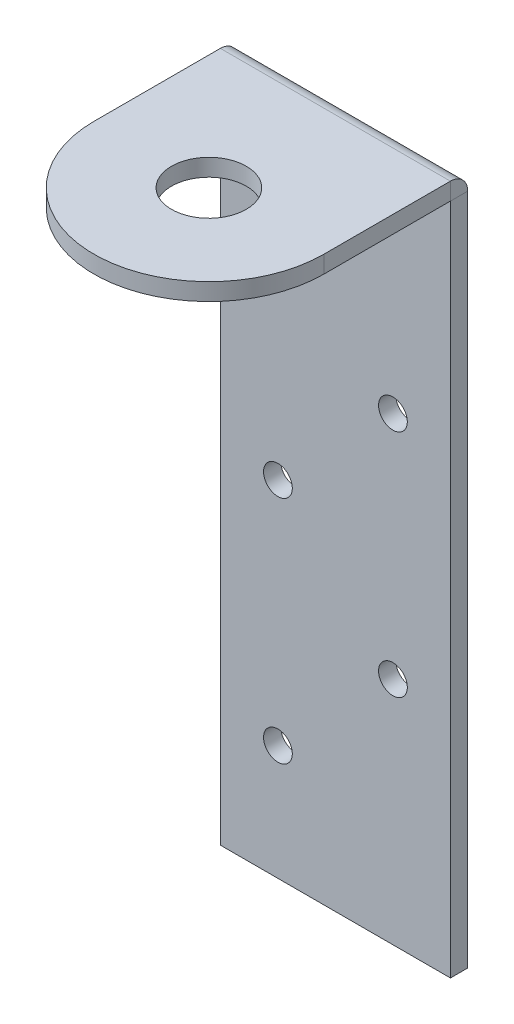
ISO-10303-21;
HEADER;
FILE_DESCRIPTION(('STEP AP214'),'2;1');
FILE_NAME('part.step','',(''),(''),'','','');
FILE_SCHEMA(('AUTOMOTIVE_DESIGN { 1 0 10303 214 1 1 1 1 }'));
ENDSEC;
DATA;
#1=APPLICATION_CONTEXT('core data for automotive mechanical design processes');
#2=APPLICATION_PROTOCOL_DEFINITION('international standard','automotive_design',2000,#1);
#3=PRODUCT_CONTEXT('',#1,'mechanical');
#4=PRODUCT('Part','Part','',(#3));
#5=PRODUCT_RELATED_PRODUCT_CATEGORY('part','',(#4));
#6=PRODUCT_DEFINITION_FORMATION('','',#4);
#7=PRODUCT_DEFINITION_CONTEXT('part definition',#1,'design');
#8=PRODUCT_DEFINITION('design','',#6,#7);
#9=PRODUCT_DEFINITION_SHAPE('','',#8);
#10=(LENGTH_UNIT() NAMED_UNIT(*) SI_UNIT(.MILLI.,.METRE.));
#11=(NAMED_UNIT(*) PLANE_ANGLE_UNIT() SI_UNIT($,.RADIAN.));
#12=(NAMED_UNIT(*) SI_UNIT($,.STERADIAN.) SOLID_ANGLE_UNIT());
#13=UNCERTAINTY_MEASURE_WITH_UNIT(LENGTH_MEASURE(1.E-05),#10,'distance_accuracy_value','');
#14=(GEOMETRIC_REPRESENTATION_CONTEXT(3) GLOBAL_UNCERTAINTY_ASSIGNED_CONTEXT((#13)) GLOBAL_UNIT_ASSIGNED_CONTEXT((#10,
#11,#12)) REPRESENTATION_CONTEXT('',''));
#15=CARTESIAN_POINT('',(0.,0.,0.));
#16=DIRECTION('',(0.,0.,1.));
#17=DIRECTION('',(1.,0.,0.));
#18=AXIS2_PLACEMENT_3D('',#15,#16,#17);
#19=CARTESIAN_POINT('',(40.,117.005,-119.995));
#20=DIRECTION('',(-1.,0.,0.));
#21=DIRECTION('',(0.,-1.,0.));
#22=AXIS2_PLACEMENT_3D('',#19,#20,#21);
#23=PLANE('',#22);
#24=DIRECTION('',(0.,0.,1.));
#25=VECTOR('',#24,1.);
#26=CARTESIAN_POINT('',(40.,117.005,-119.995));
#27=LINE('',#26,#25);
#28=CARTESIAN_POINT('',(40.,117.005,3.01));
#29=VERTEX_POINT('',#28);
#30=CARTESIAN_POINT('',(40.,117.005,25.005));
#31=VERTEX_POINT('',#30);
#32=EDGE_CURVE('E39',#29,#31,#27,.T.);
#33=ORIENTED_EDGE('',*,*,#32,.F.);
#34=DIRECTION('',(0.,1.,0.));
#35=VECTOR('',#34,1.);
#36=CARTESIAN_POINT('',(40.,117.004999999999,3.00999999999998));
#37=LINE('',#36,#35);
#38=CARTESIAN_POINT('',(40.,120.005,3.01000000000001));
#39=VERTEX_POINT('',#38);
#40=EDGE_CURVE('E12',#29,#39,#37,.T.);
#41=ORIENTED_EDGE('',*,*,#40,.T.);
#42=DIRECTION('',(0.,0.,1.));
#43=VECTOR('',#42,1.);
#44=CARTESIAN_POINT('',(40.,120.005,-119.995));
#45=LINE('',#44,#43);
#46=CARTESIAN_POINT('',(40.,120.005,25.005));
#47=VERTEX_POINT('',#46);
#48=EDGE_CURVE('E52',#39,#47,#45,.T.);
#49=ORIENTED_EDGE('',*,*,#48,.T.);
#50=DIRECTION('',(0.,1.,0.));
#51=VECTOR('',#50,1.);
#52=CARTESIAN_POINT('',(40.,117.005,25.005));
#53=LINE('',#52,#51);
#54=EDGE_CURVE('E196',#31,#47,#53,.T.);
#55=ORIENTED_EDGE('',*,*,#54,.F.);
#56=EDGE_LOOP('',(#33,#41,#49,#55));
#57=FACE_BOUND('',#56,.T.);
#58=ADVANCED_FACE('F36',(#57),#23,.F.);
#59=CARTESIAN_POINT('',(0.,117.005,-119.995));
#60=DIRECTION('',(1.,0.,0.));
#61=DIRECTION('',(0.,1.,0.));
#62=AXIS2_PLACEMENT_3D('',#59,#60,#61);
#63=PLANE('',#62);
#64=DIRECTION('',(0.,0.,-1.));
#65=VECTOR('',#64,1.);
#66=CARTESIAN_POINT('',(0.,120.005,-119.995));
#67=LINE('',#66,#65);
#68=CARTESIAN_POINT('',(0.,120.005,25.005));
#69=VERTEX_POINT('',#68);
#70=CARTESIAN_POINT('',(0.,120.005,3.01000000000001));
#71=VERTEX_POINT('',#70);
#72=EDGE_CURVE('E59',#69,#71,#67,.T.);
#73=ORIENTED_EDGE('',*,*,#72,.T.);
#74=DIRECTION('',(0.,-1.,0.));
#75=VECTOR('',#74,1.);
#76=CARTESIAN_POINT('',(0.,117.004999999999,3.00999999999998));
#77=LINE('',#76,#75);
#78=CARTESIAN_POINT('',(0.,117.005000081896,3.01));
#79=VERTEX_POINT('',#78);
#80=EDGE_CURVE('E200',#71,#79,#77,.T.);
#81=ORIENTED_EDGE('',*,*,#80,.T.);
#82=DIRECTION('',(0.,0.,-1.));
#83=VECTOR('',#82,1.);
#84=CARTESIAN_POINT('',(0.,117.005,-119.995));
#85=LINE('',#84,#83);
#86=CARTESIAN_POINT('',(0.,117.005,25.005));
#87=VERTEX_POINT('',#86);
#88=EDGE_CURVE('E191',#87,#79,#85,.T.);
#89=ORIENTED_EDGE('',*,*,#88,.F.);
#90=DIRECTION('',(0.,1.,0.));
#91=VECTOR('',#90,1.);
#92=CARTESIAN_POINT('',(0.,117.005,25.005));
#93=LINE('',#92,#91);
#94=EDGE_CURVE('E194',#87,#69,#93,.T.);
#95=ORIENTED_EDGE('',*,*,#94,.T.);
#96=EDGE_LOOP('',(#73,#81,#89,#95));
#97=FACE_BOUND('',#96,.T.);
#98=ADVANCED_FACE('F217',(#97),#63,.F.);
#99=CARTESIAN_POINT('',(20.,120.005,25.005));
#100=DIRECTION('',(0.,-1.,0.));
#101=DIRECTION('',(1.,0.,0.));
#102=AXIS2_PLACEMENT_3D('',#99,#100,#101);
#103=PLANE('',#102);
#104=CARTESIAN_POINT('',(20.,120.005,25.005));
#105=DIRECTION('',(0.,-1.,0.));
#106=DIRECTION('',(1.,0.,0.));
#107=AXIS2_PLACEMENT_3D('',#104,#105,#106);
#108=CIRCLE('',#107,6.5);
#109=CARTESIAN_POINT('',(26.5,120.005,25.005));
#110=VERTEX_POINT('',#109);
#111=EDGE_CURVE('E149',#110,#110,#108,.T.);
#112=ORIENTED_EDGE('',*,*,#111,.T.);
#113=EDGE_LOOP('',(#112));
#114=FACE_BOUND('',#113,.T.);
#115=ORIENTED_EDGE('',*,*,#48,.F.);
#116=DIRECTION('',(-1.,0.,0.));
#117=VECTOR('',#116,1.);
#118=CARTESIAN_POINT('',(20.,120.005,3.01000000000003));
#119=LINE('',#118,#117);
#120=EDGE_CURVE('E44',#39,#71,#119,.T.);
#121=ORIENTED_EDGE('',*,*,#120,.T.);
#122=ORIENTED_EDGE('',*,*,#72,.F.);
#123=CARTESIAN_POINT('',(20.,120.005,25.005));
#124=DIRECTION('',(0.,-1.,0.));
#125=DIRECTION('',(1.,0.,0.));
#126=AXIS2_PLACEMENT_3D('',#123,#124,#125);
#127=CIRCLE('',#126,20.);
#128=EDGE_CURVE('E189',#47,#69,#127,.T.);
#129=ORIENTED_EDGE('',*,*,#128,.F.);
#130=EDGE_LOOP('',(#115,#121,#122,#129));
#131=FACE_BOUND('',#130,.T.);
#132=ADVANCED_FACE('F256',(#114,#131),#103,.F.);
#133=CARTESIAN_POINT('',(20.,117.005,25.005));
#134=DIRECTION('',(0.,-1.,0.));
#135=DIRECTION('',(1.,0.,0.));
#136=AXIS2_PLACEMENT_3D('',#133,#134,#135);
#137=PLANE('',#136);
#138=DIRECTION('',(-1.,0.,0.));
#139=VECTOR('',#138,1.);
#140=CARTESIAN_POINT('',(20.,117.005,3.00999999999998));
#141=LINE('',#140,#139);
#142=EDGE_CURVE('E138',#29,#79,#141,.T.);
#143=ORIENTED_EDGE('',*,*,#142,.F.);
#144=ORIENTED_EDGE('',*,*,#32,.T.);
#145=CARTESIAN_POINT('',(20.,117.005,25.005));
#146=DIRECTION('',(0.,-1.,0.));
#147=DIRECTION('',(1.,0.,0.));
#148=AXIS2_PLACEMENT_3D('',#145,#146,#147);
#149=CIRCLE('',#148,20.);
#150=EDGE_CURVE('E192',#31,#87,#149,.T.);
#151=ORIENTED_EDGE('',*,*,#150,.T.);
#152=ORIENTED_EDGE('',*,*,#88,.T.);
#153=EDGE_LOOP('',(#143,#144,#151,#152));
#154=FACE_BOUND('',#153,.T.);
#155=CARTESIAN_POINT('',(20.,117.005,25.005));
#156=DIRECTION('',(0.,-1.,0.));
#157=DIRECTION('',(1.,0.,0.));
#158=AXIS2_PLACEMENT_3D('',#155,#156,#157);
#159=CIRCLE('',#158,6.5);
#160=CARTESIAN_POINT('',(26.5,117.005,25.005));
#161=VERTEX_POINT('',#160);
#162=EDGE_CURVE('E186',#161,#161,#159,.T.);
#163=ORIENTED_EDGE('',*,*,#162,.F.);
#164=EDGE_LOOP('',(#163));
#165=FACE_BOUND('',#164,.T.);
#166=ADVANCED_FACE('F209',(#154,#165),#137,.T.);
#167=CARTESIAN_POINT('',(20.,117.005,25.005));
#168=DIRECTION('',(0.,1.,0.));
#169=DIRECTION('',(-1.,0.,0.));
#170=AXIS2_PLACEMENT_3D('',#167,#168,#169);
#171=CYLINDRICAL_SURFACE('',#170,20.);
#172=ORIENTED_EDGE('',*,*,#128,.T.);
#173=ORIENTED_EDGE('',*,*,#94,.F.);
#174=ORIENTED_EDGE('',*,*,#150,.F.);
#175=ORIENTED_EDGE('',*,*,#54,.T.);
#176=EDGE_LOOP('',(#172,#173,#174,#175));
#177=FACE_BOUND('',#176,.T.);
#178=ADVANCED_FACE('F216',(#177),#171,.T.);
#179=CARTESIAN_POINT('',(20.,117.005,25.005));
#180=DIRECTION('',(0.,1.,0.));
#181=DIRECTION('',(-1.,0.,0.));
#182=AXIS2_PLACEMENT_3D('',#179,#180,#181);
#183=CYLINDRICAL_SURFACE('',#182,6.5);
#184=ORIENTED_EDGE('',*,*,#162,.T.);
#185=EDGE_LOOP('',(#184));
#186=FACE_BOUND('',#185,.T.);
#187=ORIENTED_EDGE('',*,*,#111,.F.);
#188=EDGE_LOOP('',(#187));
#189=FACE_BOUND('',#188,.T.);
#190=ADVANCED_FACE('F240',(#186,#189),#183,.F.);
#191=CARTESIAN_POINT('',(0.,0.,3.));
#192=DIRECTION('',(0.,1.,0.));
#193=DIRECTION('',(0.,0.,1.));
#194=AXIS2_PLACEMENT_3D('',#191,#192,#193);
#195=PLANE('',#194);
#196=DIRECTION('',(1.,0.,0.));
#197=VECTOR('',#196,1.);
#198=CARTESIAN_POINT('',(0.,0.,0.));
#199=LINE('',#198,#197);
#200=CARTESIAN_POINT('',(0.,0.,0.));
#201=VERTEX_POINT('',#200);
#202=CARTESIAN_POINT('',(40.,0.,0.));
#203=VERTEX_POINT('',#202);
#204=EDGE_CURVE('E133',#201,#203,#199,.T.);
#205=ORIENTED_EDGE('',*,*,#204,.T.);
#206=DIRECTION('',(0.,0.,-1.));
#207=VECTOR('',#206,1.);
#208=CARTESIAN_POINT('',(40.,0.,3.));
#209=LINE('',#208,#207);
#210=CARTESIAN_POINT('',(40.,0.,3.));
#211=VERTEX_POINT('',#210);
#212=EDGE_CURVE('E150',#211,#203,#209,.T.);
#213=ORIENTED_EDGE('',*,*,#212,.F.);
#214=DIRECTION('',(1.,0.,0.));
#215=VECTOR('',#214,1.);
#216=CARTESIAN_POINT('',(0.,0.,3.));
#217=LINE('',#216,#215);
#218=CARTESIAN_POINT('',(0.,0.,3.));
#219=VERTEX_POINT('',#218);
#220=EDGE_CURVE('E112',#219,#211,#217,.T.);
#221=ORIENTED_EDGE('',*,*,#220,.F.);
#222=DIRECTION('',(0.,0.,-1.));
#223=VECTOR('',#222,1.);
#224=CARTESIAN_POINT('',(0.,0.,3.));
#225=LINE('',#224,#223);
#226=EDGE_CURVE('E109',#219,#201,#225,.T.);
#227=ORIENTED_EDGE('',*,*,#226,.T.);
#228=EDGE_LOOP('',(#205,#213,#221,#227));
#229=FACE_BOUND('',#228,.T.);
#230=ADVANCED_FACE('F237',(#229),#195,.F.);
#231=CARTESIAN_POINT('',(30.,80.,3.));
#232=DIRECTION('',(0.,0.,-1.));
#233=DIRECTION('',(-1.,0.,0.));
#234=AXIS2_PLACEMENT_3D('',#231,#232,#233);
#235=CYLINDRICAL_SURFACE('',#234,2.5);
#236=CARTESIAN_POINT('',(30.,80.,3.));
#237=DIRECTION('',(0.,0.,1.));
#238=DIRECTION('',(1.,0.,0.));
#239=AXIS2_PLACEMENT_3D('',#236,#237,#238);
#240=CIRCLE('',#239,2.5);
#241=CARTESIAN_POINT('',(32.5,80.,3.));
#242=VERTEX_POINT('',#241);
#243=EDGE_CURVE('E178',#242,#242,#240,.T.);
#244=ORIENTED_EDGE('',*,*,#243,.T.);
#245=EDGE_LOOP('',(#244));
#246=FACE_BOUND('',#245,.T.);
#247=CARTESIAN_POINT('',(30.,80.,0.));
#248=DIRECTION('',(0.,0.,1.));
#249=DIRECTION('',(1.,0.,0.));
#250=AXIS2_PLACEMENT_3D('',#247,#248,#249);
#251=CIRCLE('',#250,2.5);
#252=CARTESIAN_POINT('',(32.5,80.,0.));
#253=VERTEX_POINT('',#252);
#254=EDGE_CURVE('E153',#253,#253,#251,.T.);
#255=ORIENTED_EDGE('',*,*,#254,.F.);
#256=EDGE_LOOP('',(#255));
#257=FACE_BOUND('',#256,.T.);
#258=ADVANCED_FACE('F239',(#246,#257),#235,.F.);
#259=CARTESIAN_POINT('',(30.,40.,3.));
#260=DIRECTION('',(0.,0.,-1.));
#261=DIRECTION('',(-1.,0.,0.));
#262=AXIS2_PLACEMENT_3D('',#259,#260,#261);
#263=CYLINDRICAL_SURFACE('',#262,2.5);
#264=CARTESIAN_POINT('',(30.,40.,3.));
#265=DIRECTION('',(0.,0.,1.));
#266=DIRECTION('',(1.,0.,0.));
#267=AXIS2_PLACEMENT_3D('',#264,#265,#266);
#268=CIRCLE('',#267,2.5);
#269=CARTESIAN_POINT('',(32.5,40.,3.));
#270=VERTEX_POINT('',#269);
#271=EDGE_CURVE('E175',#270,#270,#268,.T.);
#272=ORIENTED_EDGE('',*,*,#271,.T.);
#273=EDGE_LOOP('',(#272));
#274=FACE_BOUND('',#273,.T.);
#275=CARTESIAN_POINT('',(30.,40.,0.));
#276=DIRECTION('',(0.,0.,1.));
#277=DIRECTION('',(1.,0.,0.));
#278=AXIS2_PLACEMENT_3D('',#275,#276,#277);
#279=CIRCLE('',#278,2.5);
#280=CARTESIAN_POINT('',(32.5,40.,0.));
#281=VERTEX_POINT('',#280);
#282=EDGE_CURVE('E156',#281,#281,#279,.T.);
#283=ORIENTED_EDGE('',*,*,#282,.F.);
#284=EDGE_LOOP('',(#283));
#285=FACE_BOUND('',#284,.T.);
#286=ADVANCED_FACE('F246',(#274,#285),#263,.F.);
#287=CARTESIAN_POINT('',(10.,20.,3.));
#288=DIRECTION('',(0.,0.,-1.));
#289=DIRECTION('',(-1.,0.,0.));
#290=AXIS2_PLACEMENT_3D('',#287,#288,#289);
#291=CYLINDRICAL_SURFACE('',#290,2.5);
#292=CARTESIAN_POINT('',(10.,20.,3.));
#293=DIRECTION('',(0.,0.,1.));
#294=DIRECTION('',(1.,0.,0.));
#295=AXIS2_PLACEMENT_3D('',#292,#293,#294);
#296=CIRCLE('',#295,2.5);
#297=CARTESIAN_POINT('',(12.5,20.,3.));
#298=VERTEX_POINT('',#297);
#299=EDGE_CURVE('E172',#298,#298,#296,.T.);
#300=ORIENTED_EDGE('',*,*,#299,.T.);
#301=EDGE_LOOP('',(#300));
#302=FACE_BOUND('',#301,.T.);
#303=CARTESIAN_POINT('',(10.,20.,0.));
#304=DIRECTION('',(0.,0.,1.));
#305=DIRECTION('',(1.,0.,0.));
#306=AXIS2_PLACEMENT_3D('',#303,#304,#305);
#307=CIRCLE('',#306,2.5);
#308=CARTESIAN_POINT('',(12.5,20.,0.));
#309=VERTEX_POINT('',#308);
#310=EDGE_CURVE('E159',#309,#309,#307,.T.);
#311=ORIENTED_EDGE('',*,*,#310,.F.);
#312=EDGE_LOOP('',(#311));
#313=FACE_BOUND('',#312,.T.);
#314=ADVANCED_FACE('F279',(#302,#313),#291,.F.);
#315=CARTESIAN_POINT('',(10.,60.,3.));
#316=DIRECTION('',(0.,0.,-1.));
#317=DIRECTION('',(-1.,0.,0.));
#318=AXIS2_PLACEMENT_3D('',#315,#316,#317);
#319=CYLINDRICAL_SURFACE('',#318,2.5);
#320=CARTESIAN_POINT('',(10.,60.,3.));
#321=DIRECTION('',(0.,0.,1.));
#322=DIRECTION('',(1.,0.,0.));
#323=AXIS2_PLACEMENT_3D('',#320,#321,#322);
#324=CIRCLE('',#323,2.5);
#325=CARTESIAN_POINT('',(12.5,60.,3.));
#326=VERTEX_POINT('',#325);
#327=EDGE_CURVE('E169',#326,#326,#324,.T.);
#328=ORIENTED_EDGE('',*,*,#327,.T.);
#329=EDGE_LOOP('',(#328));
#330=FACE_BOUND('',#329,.T.);
#331=CARTESIAN_POINT('',(10.,60.,0.));
#332=DIRECTION('',(0.,0.,1.));
#333=DIRECTION('',(1.,0.,0.));
#334=AXIS2_PLACEMENT_3D('',#331,#332,#333);
#335=CIRCLE('',#334,2.5);
#336=CARTESIAN_POINT('',(12.5,60.,0.));
#337=VERTEX_POINT('',#336);
#338=EDGE_CURVE('E162',#337,#337,#335,.T.);
#339=ORIENTED_EDGE('',*,*,#338,.F.);
#340=EDGE_LOOP('',(#339));
#341=FACE_BOUND('',#340,.T.);
#342=ADVANCED_FACE('F275',(#330,#341),#319,.F.);
#343=CARTESIAN_POINT('',(20.,145.,3.));
#344=DIRECTION('',(0.,0.,1.));
#345=DIRECTION('',(1.,0.,0.));
#346=AXIS2_PLACEMENT_3D('',#343,#344,#345);
#347=PLANE('',#346);
#348=ORIENTED_EDGE('',*,*,#327,.F.);
#349=EDGE_LOOP('',(#348));
#350=FACE_BOUND('',#349,.T.);
#351=ORIENTED_EDGE('',*,*,#299,.F.);
#352=EDGE_LOOP('',(#351));
#353=FACE_BOUND('',#352,.T.);
#354=ORIENTED_EDGE('',*,*,#271,.F.);
#355=EDGE_LOOP('',(#354));
#356=FACE_BOUND('',#355,.T.);
#357=ORIENTED_EDGE('',*,*,#243,.F.);
#358=EDGE_LOOP('',(#357));
#359=FACE_BOUND('',#358,.T.);
#360=DIRECTION('',(0.,1.,0.));
#361=VECTOR('',#360,1.);
#362=CARTESIAN_POINT('',(40.,0.,3.));
#363=LINE('',#362,#361);
#364=CARTESIAN_POINT('',(40.,116.995,3.));
#365=VERTEX_POINT('',#364);
#366=EDGE_CURVE('E118',#211,#365,#363,.T.);
#367=ORIENTED_EDGE('',*,*,#366,.T.);
#368=DIRECTION('',(-1.,0.,0.));
#369=VECTOR('',#368,1.);
#370=CARTESIAN_POINT('',(20.,116.995,3.));
#371=LINE('',#370,#369);
#372=CARTESIAN_POINT('',(0.,116.995,2.99999991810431));
#373=VERTEX_POINT('',#372);
#374=EDGE_CURVE('E113',#365,#373,#371,.T.);
#375=ORIENTED_EDGE('',*,*,#374,.T.);
#376=DIRECTION('',(0.,-1.,0.));
#377=VECTOR('',#376,1.);
#378=CARTESIAN_POINT('',(0.,0.,3.));
#379=LINE('',#378,#377);
#380=EDGE_CURVE('E102',#373,#219,#379,.T.);
#381=ORIENTED_EDGE('',*,*,#380,.T.);
#382=ORIENTED_EDGE('',*,*,#220,.T.);
#383=EDGE_LOOP('',(#367,#375,#381,#382));
#384=FACE_BOUND('',#383,.T.);
#385=ADVANCED_FACE('F116',(#350,#353,#356,#359,#384),#347,.T.);
#386=CARTESIAN_POINT('',(0.,0.,3.));
#387=DIRECTION('',(1.,0.,0.));
#388=DIRECTION('',(0.,0.,-1.));
#389=AXIS2_PLACEMENT_3D('',#386,#387,#388);
#390=PLANE('',#389);
#391=DIRECTION('',(0.,0.,1.));
#392=VECTOR('',#391,1.);
#393=CARTESIAN_POINT('',(0.,116.995,3.00000000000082));
#394=LINE('',#393,#392);
#395=CARTESIAN_POINT('',(0.,116.995,0.));
#396=VERTEX_POINT('',#395);
#397=EDGE_CURVE('E106',#396,#373,#394,.T.);
#398=ORIENTED_EDGE('',*,*,#397,.F.);
#399=DIRECTION('',(0.,-1.,0.));
#400=VECTOR('',#399,1.);
#401=CARTESIAN_POINT('',(0.,0.,0.));
#402=LINE('',#401,#400);
#403=EDGE_CURVE('E165',#396,#201,#402,.T.);
#404=ORIENTED_EDGE('',*,*,#403,.T.);
#405=ORIENTED_EDGE('',*,*,#226,.F.);
#406=ORIENTED_EDGE('',*,*,#380,.F.);
#407=EDGE_LOOP('',(#398,#404,#405,#406));
#408=FACE_BOUND('',#407,.T.);
#409=ADVANCED_FACE('F104',(#408),#390,.F.);
#410=CARTESIAN_POINT('',(20.,145.,0.));
#411=DIRECTION('',(0.,0.,1.));
#412=DIRECTION('',(1.,0.,0.));
#413=AXIS2_PLACEMENT_3D('',#410,#411,#412);
#414=PLANE('',#413);
#415=DIRECTION('',(-1.,0.,0.));
#416=VECTOR('',#415,1.);
#417=CARTESIAN_POINT('',(20.,116.995,0.));
#418=LINE('',#417,#416);
#419=CARTESIAN_POINT('',(40.,116.995,0.));
#420=VERTEX_POINT('',#419);
#421=EDGE_CURVE('E134',#420,#396,#418,.T.);
#422=ORIENTED_EDGE('',*,*,#421,.F.);
#423=DIRECTION('',(0.,1.,0.));
#424=VECTOR('',#423,1.);
#425=CARTESIAN_POINT('',(40.,0.,0.));
#426=LINE('',#425,#424);
#427=EDGE_CURVE('E147',#203,#420,#426,.T.);
#428=ORIENTED_EDGE('',*,*,#427,.F.);
#429=ORIENTED_EDGE('',*,*,#204,.F.);
#430=ORIENTED_EDGE('',*,*,#403,.F.);
#431=EDGE_LOOP('',(#422,#428,#429,#430));
#432=FACE_BOUND('',#431,.T.);
#433=ORIENTED_EDGE('',*,*,#338,.T.);
#434=EDGE_LOOP('',(#433));
#435=FACE_BOUND('',#434,.T.);
#436=ORIENTED_EDGE('',*,*,#310,.T.);
#437=EDGE_LOOP('',(#436));
#438=FACE_BOUND('',#437,.T.);
#439=ORIENTED_EDGE('',*,*,#282,.T.);
#440=EDGE_LOOP('',(#439));
#441=FACE_BOUND('',#440,.T.);
#442=ORIENTED_EDGE('',*,*,#254,.T.);
#443=EDGE_LOOP('',(#442));
#444=FACE_BOUND('',#443,.T.);
#445=ADVANCED_FACE('F234',(#432,#435,#438,#441,#444),#414,.F.);
#446=CARTESIAN_POINT('',(40.,0.,3.));
#447=DIRECTION('',(-1.,0.,0.));
#448=DIRECTION('',(0.,0.,1.));
#449=AXIS2_PLACEMENT_3D('',#446,#447,#448);
#450=PLANE('',#449);
#451=DIRECTION('',(0.,0.,-1.));
#452=VECTOR('',#451,1.);
#453=CARTESIAN_POINT('',(40.,116.995,3.00000000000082));
#454=LINE('',#453,#452);
#455=EDGE_CURVE('E139',#365,#420,#454,.T.);
#456=ORIENTED_EDGE('',*,*,#455,.F.);
#457=ORIENTED_EDGE('',*,*,#366,.F.);
#458=ORIENTED_EDGE('',*,*,#212,.T.);
#459=ORIENTED_EDGE('',*,*,#427,.T.);
#460=EDGE_LOOP('',(#456,#457,#458,#459));
#461=FACE_BOUND('',#460,.T.);
#462=ADVANCED_FACE('F229',(#461),#450,.F.);
#463=CARTESIAN_POINT('',(40.,116.995,3.01000008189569));
#464=DIRECTION('',(-1.,0.,0.));
#465=DIRECTION('',(0.,0.,1.));
#466=AXIS2_PLACEMENT_3D('',#463,#464,#465);
#467=PLANE('',#466);
#468=ORIENTED_EDGE('',*,*,#455,.T.);
#469=CARTESIAN_POINT('',(40.,116.995,3.01));
#470=DIRECTION('',(-1.,0.,0.));
#471=DIRECTION('',(0.,0.,1.));
#472=AXIS2_PLACEMENT_3D('',#469,#470,#471);
#473=CIRCLE('',#472,3.01000008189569);
#474=EDGE_CURVE('E224',#420,#39,#473,.F.);
#475=ORIENTED_EDGE('',*,*,#474,.T.);
#476=ORIENTED_EDGE('',*,*,#40,.F.);
#477=CARTESIAN_POINT('',(40.,116.995,3.01000008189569));
#478=DIRECTION('',(1.,0.,0.));
#479=DIRECTION('',(0.,0.,-1.));
#480=AXIS2_PLACEMENT_3D('',#477,#478,#479);
#481=CIRCLE('',#480,0.0100001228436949);
#482=EDGE_CURVE('E140',#365,#29,#481,.T.);
#483=ORIENTED_EDGE('',*,*,#482,.F.);
#484=EDGE_LOOP('',(#468,#475,#476,#483));
#485=FACE_BOUND('',#484,.T.);
#486=ADVANCED_FACE('F227',(#485),#467,.F.);
#487=CARTESIAN_POINT('',(0.,116.995,3.01000008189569));
#488=DIRECTION('',(1.,0.,0.));
#489=DIRECTION('',(0.,0.,-1.));
#490=AXIS2_PLACEMENT_3D('',#487,#488,#489);
#491=PLANE('',#490);
#492=CARTESIAN_POINT('',(0.,116.995,3.01));
#493=DIRECTION('',(-1.,0.,0.));
#494=DIRECTION('',(0.,0.,1.));
#495=AXIS2_PLACEMENT_3D('',#492,#493,#494);
#496=CIRCLE('',#495,3.01000008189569);
#497=EDGE_CURVE('E132',#71,#396,#496,.T.);
#498=ORIENTED_EDGE('',*,*,#497,.T.);
#499=ORIENTED_EDGE('',*,*,#397,.T.);
#500=CARTESIAN_POINT('',(0.,116.995,3.01000008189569));
#501=DIRECTION('',(-1.,0.,0.));
#502=DIRECTION('',(0.,0.,1.));
#503=AXIS2_PLACEMENT_3D('',#500,#501,#502);
#504=CIRCLE('',#503,0.0100001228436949);
#505=EDGE_CURVE('E130',#79,#373,#504,.T.);
#506=ORIENTED_EDGE('',*,*,#505,.F.);
#507=ORIENTED_EDGE('',*,*,#80,.F.);
#508=EDGE_LOOP('',(#498,#499,#506,#507));
#509=FACE_BOUND('',#508,.T.);
#510=ADVANCED_FACE('F128',(#509),#491,.F.);
#511=CARTESIAN_POINT('',(60.560080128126,116.995,3.01));
#512=DIRECTION('',(-1.,0.,0.));
#513=DIRECTION('',(0.,0.,1.));
#514=AXIS2_PLACEMENT_3D('',#511,#512,#513);
#515=CYLINDRICAL_SURFACE('',#514,0.0100000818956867);
#516=ORIENTED_EDGE('',*,*,#142,.T.);
#517=ORIENTED_EDGE('',*,*,#505,.T.);
#518=ORIENTED_EDGE('',*,*,#374,.F.);
#519=ORIENTED_EDGE('',*,*,#482,.T.);
#520=EDGE_LOOP('',(#516,#517,#518,#519));
#521=FACE_BOUND('',#520,.T.);
#522=ADVANCED_FACE('F137',(#521),#515,.F.);
#523=CARTESIAN_POINT('',(60.560080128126,116.995,3.01));
#524=DIRECTION('',(-1.,0.,0.));
#525=DIRECTION('',(0.,0.,1.));
#526=AXIS2_PLACEMENT_3D('',#523,#524,#525);
#527=CYLINDRICAL_SURFACE('',#526,3.01000008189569);
#528=ORIENTED_EDGE('',*,*,#120,.F.);
#529=ORIENTED_EDGE('',*,*,#474,.F.);
#530=ORIENTED_EDGE('',*,*,#421,.T.);
#531=ORIENTED_EDGE('',*,*,#497,.F.);
#532=EDGE_LOOP('',(#528,#529,#530,#531));
#533=FACE_BOUND('',#532,.T.);
#534=ADVANCED_FACE('F220',(#533),#527,.T.);
#535=CLOSED_SHELL('',(#58,#98,#132,#166,#178,#190,#230,#258,#286,#314,#342,#385,#409,#445,#462,
#486,#510,#522,#534));
#536=MANIFOLD_SOLID_BREP('B2',#535);
#537=ADVANCED_BREP_SHAPE_REPRESENTATION('',(#18,#536),#14);
#538=SHAPE_DEFINITION_REPRESENTATION(#9,#537);
ENDSEC;
END-ISO-10303-21;
